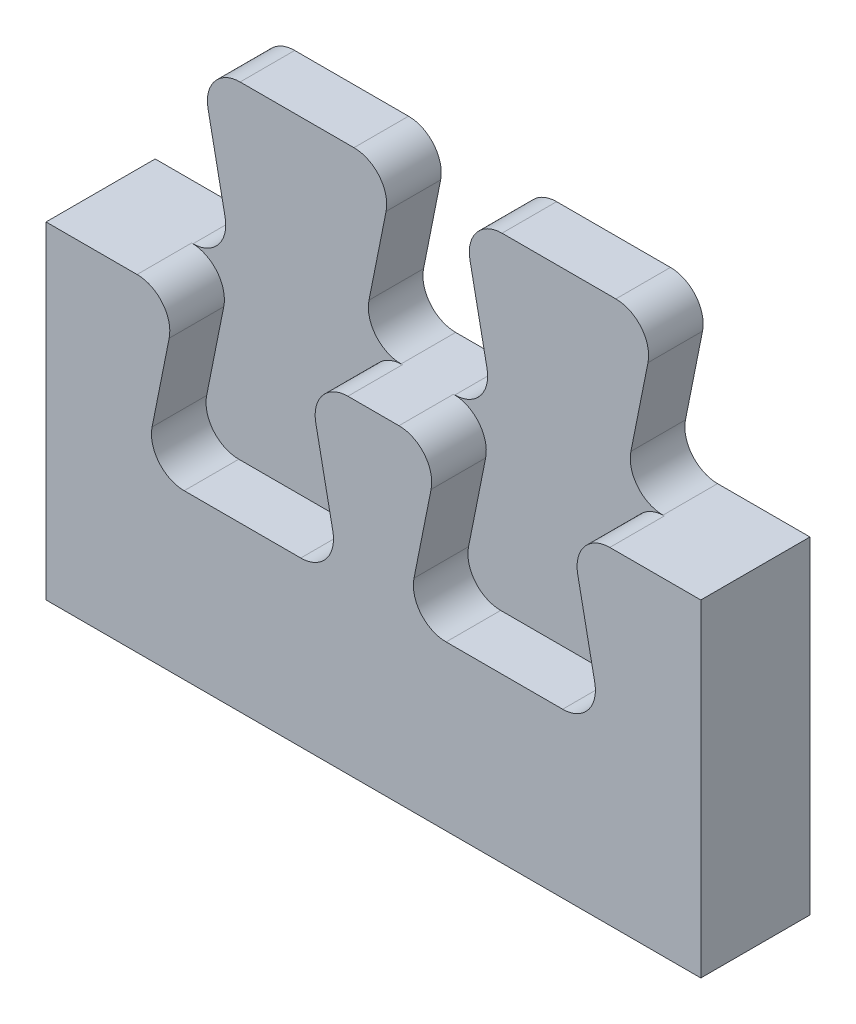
from build123d import *

# Parameters (mm, degrees)
AUFSATZ_LINEAR_AUSTRAGEN2_DEPTH = 10
SCHNITT_LINEAR_AUSTRAGEN1_DEPTH = 5
VERRUNDUNG6_R                   = 3
VERRUNDUNG7_R                   = 3


with BuildPart() as part:
    # Skizze1 → Aufsatz-Linear austragen2 (new body)
    with BuildSketch(Plane.XY):
        Polygon((-23.858921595, 36.611215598), (-11.733921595, 36.611215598), (-14.733921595, 51.611215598), (3.016078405, 51.611215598), (0.016078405, 36.611215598), (12.266078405, 36.611215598), (9.266078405, 51.611215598), (27.016078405, 51.611215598), (24.016078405, 36.611215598), (36.141078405, 36.611215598), (36.141078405, 6.611215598), (-23.858921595, 6.611215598), align=None)
    extrude(amount=AUFSATZ_LINEAR_AUSTRAGEN2_DEPTH)

    # Skizze4 → Schnitt-Linear austragen1 (cut)
    with BuildSketch(Plane.XY.offset(10)):
        Polygon((-23.858921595, 36.611215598), (-11.858921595, 36.611215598), (-14.858921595, 21.611215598), (3.141078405, 21.611215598), (0.141078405, 36.611215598), (12.141078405, 36.611215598), (9.141078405, 21.611215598), (27.141078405, 21.611215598), (24.141078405, 36.611215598), (36.141078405, 36.611215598), (36.141078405, 56.611215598), (-23.858921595, 56.611215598), align=None)
    extrude(amount=-SCHNITT_LINEAR_AUSTRAGEN1_DEPTH, mode=Mode.SUBTRACT)

    # Verrundung6
    verrundung6_edges = [part.edges().sort_by_distance(p)[0] for p in [
        (-14.733921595, 51.611215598, 2.5),
        (3.016078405, 51.611215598, 2.5),
        (9.266078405, 51.611215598, 2.5),
        (27.016078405, 51.611215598, 2.5),
        (24.141078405, 36.611215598, 7.5),
        (27.141078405, 21.611215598, 7.5),
        (9.141078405, 21.611215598, 7.5),
        (12.141078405, 36.611215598, 7.5),
        (0.141078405, 36.611215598, 7.5),
        (3.141078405, 21.611215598, 7.5),
        (-14.858921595, 21.611215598, 7.5),
        (-11.858921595, 36.611215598, 7.5),
    ]]
    fillet(verrundung6_edges, radius=VERRUNDUNG6_R)

    # Verrundung7
    verrundung7_edges = [part.edges().sort_by_distance(p)[0] for p in [
        (0.016078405, 36.611215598, 2.5),
        (12.266078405, 36.611215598, 2.5),
        (24.016078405, 36.611215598, 2.5),
        (-11.733921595, 36.611215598, 2.5),
    ]]
    fillet(verrundung7_edges, radius=VERRUNDUNG7_R)


solid = part.part
